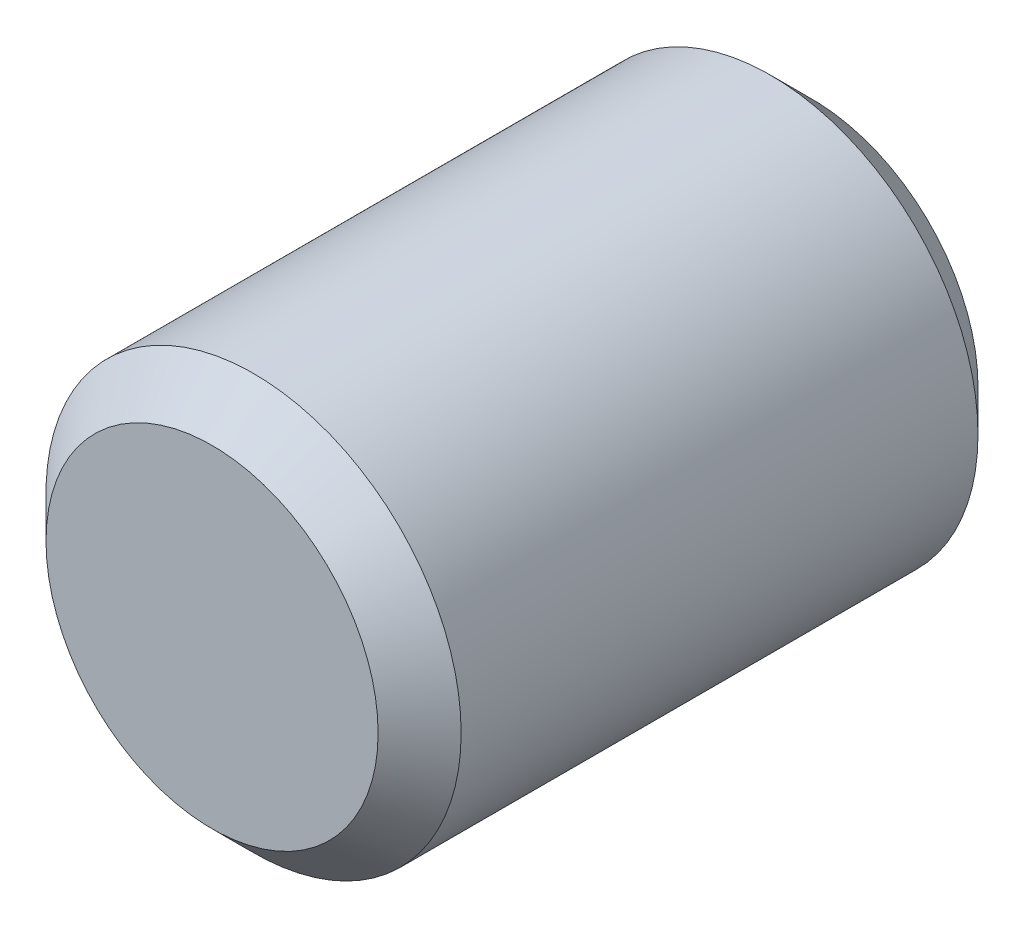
from build123d import *

# Parameters (mm, degrees)
ESQUISSE1_R          = 5
BASE_EXTRUSION_DEPTH = 14.45
CHANFREIN1_SIZE      = 1


with BuildPart() as part:
    # Esquisse1 → Base-Extrusion (new body)
    with BuildSketch(Plane.XY):
        Circle(ESQUISSE1_R)
    extrude(amount=BASE_EXTRUSION_DEPTH)

    # Chanfrein1
    chanfrein1_edges = [part.edges().sort_by_distance(p)[0] for p in [
        (-5, 0, 0),
        (-5, 0, 14.45),
    ]]
    chamfer(chanfrein1_edges, length=CHANFREIN1_SIZE)


solid = part.part
